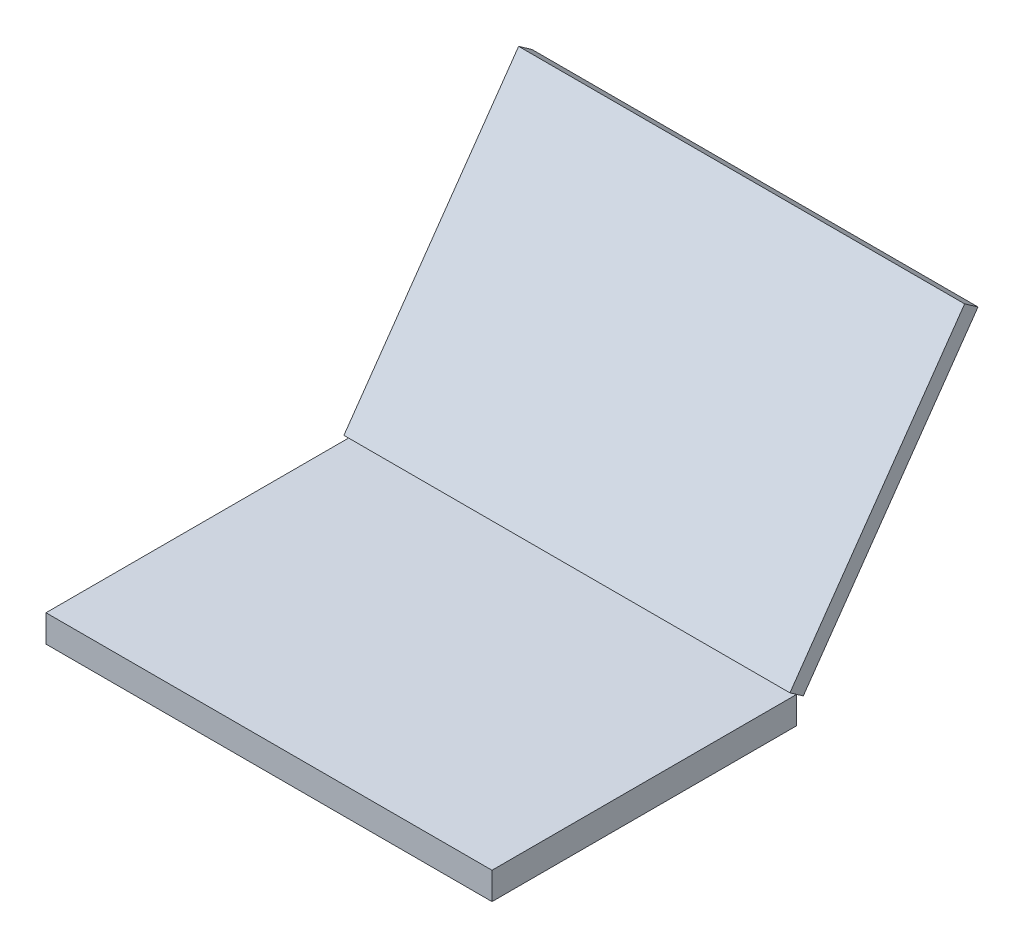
from build123d import *

# Parameters (mm, degrees)
ESQUISSE1_W        = 410
ESQUISSE1_H        = 280
BOSS_EXTRU_1_DEPTH = 12.5
ESQUISSE2_W        = 410
ESQUISSE2_H        = 280
BOSS_EXTRU_2_DEPTH = 7.5


with BuildPart() as part:
    # Esquisse1 → Boss.-Extru.1 (new, symmetric)
    with BuildSketch(Plane(origin=(0, 0, 0), x_dir=(1, 0, 0), z_dir=(0, 1, 0))):
        Rectangle(ESQUISSE1_W, ESQUISSE1_H)
    extrude(amount=BOSS_EXTRU_1_DEPTH, both=True)


with BuildPart() as body_2:
    # Esquisse2 → Boss.-Extru.2 (new, symmetric)
    with BuildSketch(Plane(origin=(0, -61.666109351, -88.068331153), x_dir=(1, 0, 0), z_dir=(0, -0.5735764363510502, -0.8191520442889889))):
        with Locations((0, -230.540101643)):
            Rectangle(ESQUISSE2_W, ESQUISSE2_H)
    extrude(amount=BOSS_EXTRU_2_DEPTH, both=True)


solid = Compound([part.part, body_2.part])
